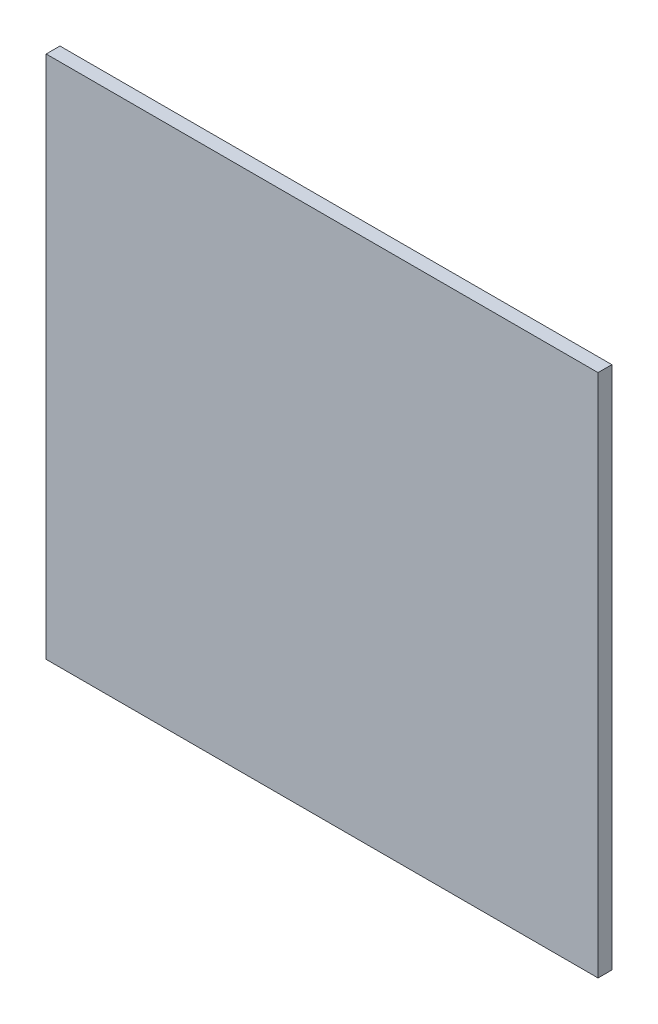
from build123d import *

# Parameters (mm, degrees)
CROQUIS1_W              = 600
CROQUIS1_H              = 570
SALIENTE_EXTRUIR3_DEPTH = 15


with BuildPart() as part:
    # Croquis1 → Saliente-Extruir3 (new body)
    with BuildSketch(Plane.XY):
        Rectangle(CROQUIS1_W, CROQUIS1_H)
    extrude(amount=SALIENTE_EXTRUIR3_DEPTH)


solid = part.part
